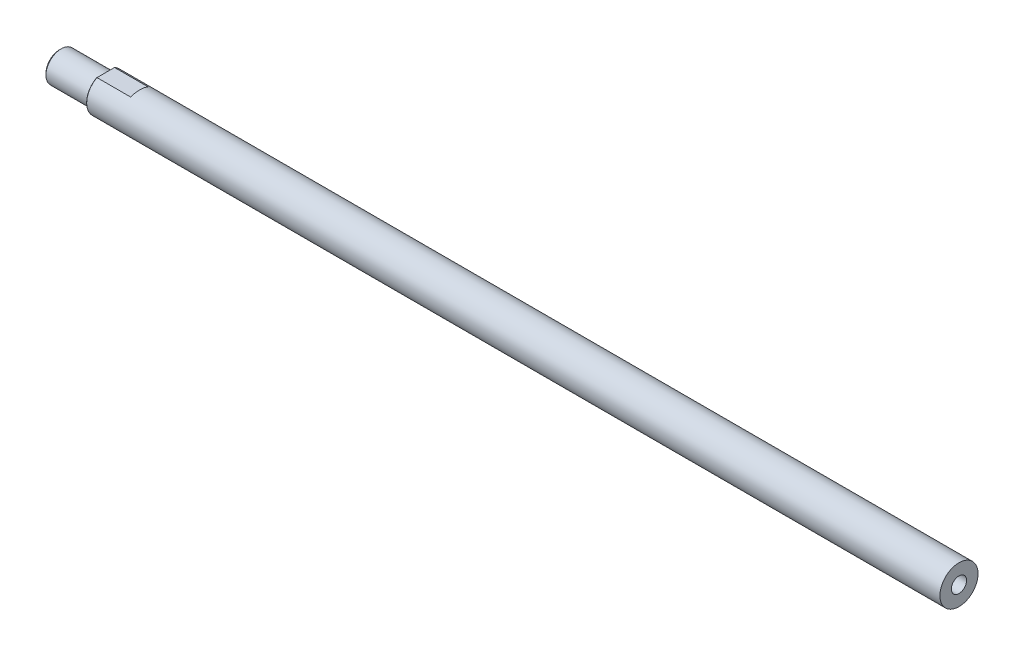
from build123d import *

# Parameters (mm, degrees)
F_5_16_24_TAPPED_HOLE1_D     = 6.9088
F_5_16_24_TAPPED_HOLE1_DEPTH = 15.875
F_5_16_24_TAPPED_HOLE1_TIP   = 2.075612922
SKETCH5_R                    = 3.175
CUT_EXTRUDE1_DEPTH           = 375.818129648
CUT_EXTRUDE2_DEPTH           = 356.777132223
CUT_EXTRUDE2_DEPTH_BACK      = 356.777132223
CHAMFER1_SIZE                = 0.762
FILLET1_R                    = 0.381
CHAMFER2_SIZE                = 0.254
CHAMFER3_SIZE                = 0.254


with BuildPart() as part:
    # Sketch1 → Revolve1 (revolve)
    with BuildSketch(Plane.XY, mode=Mode.PRIVATE) as revolve1_sk:
        Polygon((-19.05, 6.35), (0, 6.35), (0, 7.9375), (355.6, 7.9375), (355.6, 0), (-19.05, 0), align=None)
    revolve(revolve1_sk.sketch.rotate(Axis((-34.753378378, 0, 0), (1, 0, 0)), 90), axis=Axis((-34.753378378, 0, 0), (1, 0, 0)))

    # 5_16-24 Tapped Hole1
    with Locations(Plane.ZY.offset(19.05)):
        with Locations((0, 0)):
            Hole(F_5_16_24_TAPPED_HOLE1_D / 2, depth=F_5_16_24_TAPPED_HOLE1_DEPTH)
            with Locations((0, 0, -(F_5_16_24_TAPPED_HOLE1_DEPTH + F_5_16_24_TAPPED_HOLE1_TIP / 2))):  # 118° drill point
                Cone(0, F_5_16_24_TAPPED_HOLE1_D / 2, F_5_16_24_TAPPED_HOLE1_TIP, mode=Mode.SUBTRACT)

    # Sketch5 → Cut-Extrude1 (cut, through all)
    with BuildSketch(Plane(origin=(355.6, 0, 0), x_dir=(0, 0, -1), z_dir=(1, 0, 0))):
        Circle(SKETCH5_R)
    extrude(amount=-CUT_EXTRUDE1_DEPTH, mode=Mode.SUBTRACT)

    # Sketch6 → Cut-Extrude2 (cut, two sides: drawn at the far end of the back side and taken through both)
    with BuildSketch(Plane.XY.offset(-CUT_EXTRUDE2_DEPTH_BACK)):
        Polygon((0, 7.0485), (14.224, 7.0485), (14.462206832, 7.9375), (0, 7.9375), align=None)
    extrude(amount=CUT_EXTRUDE2_DEPTH + CUT_EXTRUDE2_DEPTH_BACK, mode=Mode.SUBTRACT)

    # Chamfer1
    chamfer1_edges = [part.edges().sort_by_distance(p)[0] for p in [
        (-19.05, 0, -6.35),
    ]]
    chamfer(chamfer1_edges, length=CHAMFER1_SIZE)

    # Fillet1
    fillet1_edges = [part.edges().sort_by_distance(p)[0] for p in [
        (0, 0, -6.35),
    ]]
    fillet(fillet1_edges, radius=FILLET1_R)

    # Chamfer2
    chamfer2_edges = [part.edges().sort_by_distance(p)[0] for p in [
        (0, -6.781439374, -4.12504379),
    ]]
    chamfer(chamfer2_edges, length=CHAMFER2_SIZE)

    # Chamfer3
    chamfer3_edges = [part.edges().sort_by_distance(p)[0] for p in [
        (0, 7.0485, 0),
    ]]
    chamfer(chamfer3_edges, length=CHAMFER3_SIZE)


solid = part.part
